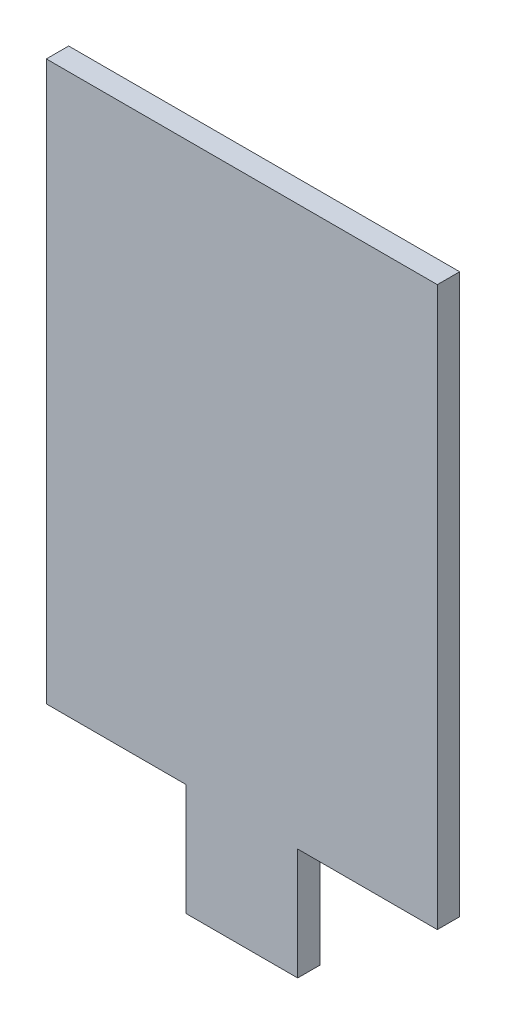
from build123d import *

# Parameters (mm, degrees)
EXTRUDE_1_DEPTH = 1.6


with BuildPart() as part:
    # Sketch 1 → Extrude 1 (new body)
    with BuildSketch(Plane.XY):
        Polygon((-14, -20), (-4, -20), (-4, -28), (4, -28), (4, -20), (14, -20), (14, 20), (-14, 20), align=None)
    extrude(amount=EXTRUDE_1_DEPTH)


solid = part.part
